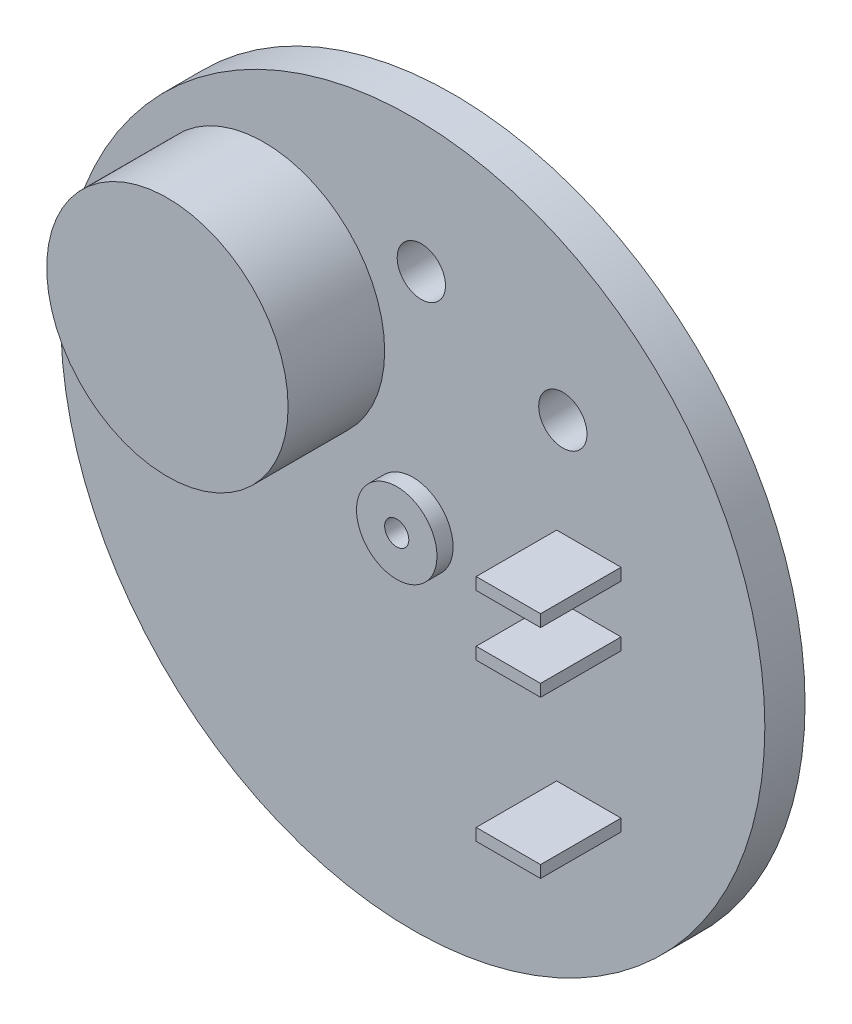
ISO-10303-21;
HEADER;
FILE_DESCRIPTION(('STEP AP214'),'2;1');
FILE_NAME('part.step','',(''),(''),'','','');
FILE_SCHEMA(('AUTOMOTIVE_DESIGN { 1 0 10303 214 1 1 1 1 }'));
ENDSEC;
DATA;
#1=APPLICATION_CONTEXT('core data for automotive mechanical design processes');
#2=APPLICATION_PROTOCOL_DEFINITION('international standard','automotive_design',2000,#1);
#3=PRODUCT_CONTEXT('',#1,'mechanical');
#4=PRODUCT('Part','Part','',(#3));
#5=PRODUCT_RELATED_PRODUCT_CATEGORY('part','',(#4));
#6=PRODUCT_DEFINITION_FORMATION('','',#4);
#7=PRODUCT_DEFINITION_CONTEXT('part definition',#1,'design');
#8=PRODUCT_DEFINITION('design','',#6,#7);
#9=PRODUCT_DEFINITION_SHAPE('','',#8);
#10=(LENGTH_UNIT() NAMED_UNIT(*) SI_UNIT(.MILLI.,.METRE.));
#11=(NAMED_UNIT(*) PLANE_ANGLE_UNIT() SI_UNIT($,.RADIAN.));
#12=(NAMED_UNIT(*) SI_UNIT($,.STERADIAN.) SOLID_ANGLE_UNIT());
#13=UNCERTAINTY_MEASURE_WITH_UNIT(LENGTH_MEASURE(1.E-05),#10,'distance_accuracy_value','');
#14=(GEOMETRIC_REPRESENTATION_CONTEXT(3) GLOBAL_UNCERTAINTY_ASSIGNED_CONTEXT((#13)) GLOBAL_UNIT_ASSIGNED_CONTEXT((#10,
#11,#12)) REPRESENTATION_CONTEXT('',''));
#15=CARTESIAN_POINT('',(0.,0.,0.));
#16=DIRECTION('',(0.,0.,1.));
#17=DIRECTION('',(1.,0.,0.));
#18=AXIS2_PLACEMENT_3D('',#15,#16,#17);
#19=CARTESIAN_POINT('',(0.,0.,5.));
#20=DIRECTION('',(0.,0.,1.));
#21=DIRECTION('',(1.,0.,0.));
#22=AXIS2_PLACEMENT_3D('',#19,#20,#21);
#23=PLANE('',#22);
#24=CARTESIAN_POINT('',(1.05618677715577,27.6610641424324,5.));
#25=DIRECTION('',(0.,0.,1.));
#26=DIRECTION('',(1.,0.,0.));
#27=AXIS2_PLACEMENT_3D('',#24,#25,#26);
#28=CIRCLE('',#27,3.);
#29=CARTESIAN_POINT('',(4.05618677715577,27.6610641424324,5.));
#30=VERTEX_POINT('',#29);
#31=EDGE_CURVE('E331',#30,#30,#28,.T.);
#32=ORIENTED_EDGE('',*,*,#31,.F.);
#33=EDGE_LOOP('',(#32));
#34=FACE_BOUND('',#33,.T.);
#35=CARTESIAN_POINT('',(18.6404268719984,20.4642245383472,5.));
#36=DIRECTION('',(0.,0.,1.));
#37=DIRECTION('',(1.,0.,0.));
#38=AXIS2_PLACEMENT_3D('',#35,#36,#37);
#39=CIRCLE('',#38,3.);
#40=CARTESIAN_POINT('',(21.6404268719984,20.4642245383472,5.));
#41=VERTEX_POINT('',#40);
#42=EDGE_CURVE('E334',#41,#41,#39,.T.);
#43=ORIENTED_EDGE('',*,*,#42,.F.);
#44=EDGE_LOOP('',(#43));
#45=FACE_BOUND('',#44,.T.);
#46=DIRECTION('',(-1.,0.,0.));
#47=VECTOR('',#46,1.);
#48=CARTESIAN_POINT('',(17.875,-18.75,5.));
#49=LINE('',#48,#47);
#50=CARTESIAN_POINT('',(25.875,-18.75,5.));
#51=VERTEX_POINT('',#50);
#52=CARTESIAN_POINT('',(17.875,-18.75,5.));
#53=VERTEX_POINT('',#52);
#54=EDGE_CURVE('E150',#51,#53,#49,.T.);
#55=ORIENTED_EDGE('',*,*,#54,.F.);
#56=DIRECTION('',(0.,1.,0.));
#57=VECTOR('',#56,1.);
#58=CARTESIAN_POINT('',(25.875,-20.25,5.));
#59=LINE('',#58,#57);
#60=CARTESIAN_POINT('',(25.875,-20.25,5.));
#61=VERTEX_POINT('',#60);
#62=EDGE_CURVE('E144',#61,#51,#59,.T.);
#63=ORIENTED_EDGE('',*,*,#62,.F.);
#64=DIRECTION('',(1.,0.,0.));
#65=VECTOR('',#64,1.);
#66=CARTESIAN_POINT('',(17.875,-20.25,5.));
#67=LINE('',#66,#65);
#68=CARTESIAN_POINT('',(17.875,-20.25,5.));
#69=VERTEX_POINT('',#68);
#70=EDGE_CURVE('E129',#69,#61,#67,.T.);
#71=ORIENTED_EDGE('',*,*,#70,.F.);
#72=DIRECTION('',(0.,-1.,0.));
#73=VECTOR('',#72,1.);
#74=CARTESIAN_POINT('',(17.875,-20.25,5.));
#75=LINE('',#74,#73);
#76=EDGE_CURVE('E137',#53,#69,#75,.T.);
#77=ORIENTED_EDGE('',*,*,#76,.F.);
#78=EDGE_LOOP('',(#55,#63,#71,#77));
#79=FACE_BOUND('',#78,.T.);
#80=DIRECTION('',(-1.,0.,0.));
#81=VECTOR('',#80,1.);
#82=CARTESIAN_POINT('',(17.875,8.25,5.));
#83=LINE('',#82,#81);
#84=CARTESIAN_POINT('',(25.875,8.25,5.));
#85=VERTEX_POINT('',#84);
#86=CARTESIAN_POINT('',(17.875,8.25,5.));
#87=VERTEX_POINT('',#86);
#88=EDGE_CURVE('E176',#85,#87,#83,.T.);
#89=ORIENTED_EDGE('',*,*,#88,.F.);
#90=DIRECTION('',(0.,1.,0.));
#91=VECTOR('',#90,1.);
#92=CARTESIAN_POINT('',(25.875,6.75,5.));
#93=LINE('',#92,#91);
#94=CARTESIAN_POINT('',(25.875,6.75,5.));
#95=VERTEX_POINT('',#94);
#96=EDGE_CURVE('E178',#95,#85,#93,.T.);
#97=ORIENTED_EDGE('',*,*,#96,.F.);
#98=DIRECTION('',(1.,0.,0.));
#99=VECTOR('',#98,1.);
#100=CARTESIAN_POINT('',(17.875,6.75,5.));
#101=LINE('',#100,#99);
#102=CARTESIAN_POINT('',(17.875,6.75,5.));
#103=VERTEX_POINT('',#102);
#104=EDGE_CURVE('E171',#103,#95,#101,.T.);
#105=ORIENTED_EDGE('',*,*,#104,.F.);
#106=DIRECTION('',(0.,-1.,0.));
#107=VECTOR('',#106,1.);
#108=CARTESIAN_POINT('',(17.875,6.75,5.));
#109=LINE('',#108,#107);
#110=EDGE_CURVE('E173',#87,#103,#109,.T.);
#111=ORIENTED_EDGE('',*,*,#110,.F.);
#112=EDGE_LOOP('',(#89,#97,#105,#111));
#113=FACE_BOUND('',#112,.T.);
#114=DIRECTION('',(-1.,0.,0.));
#115=VECTOR('',#114,1.);
#116=CARTESIAN_POINT('',(17.875,0.75,5.));
#117=LINE('',#116,#115);
#118=CARTESIAN_POINT('',(25.875,0.75,5.));
#119=VERTEX_POINT('',#118);
#120=CARTESIAN_POINT('',(17.875,0.75,5.));
#121=VERTEX_POINT('',#120);
#122=EDGE_CURVE('E202',#119,#121,#117,.T.);
#123=ORIENTED_EDGE('',*,*,#122,.F.);
#124=DIRECTION('',(0.,1.,0.));
#125=VECTOR('',#124,1.);
#126=CARTESIAN_POINT('',(25.875,-0.75,5.));
#127=LINE('',#126,#125);
#128=CARTESIAN_POINT('',(25.875,-0.75,5.));
#129=VERTEX_POINT('',#128);
#130=EDGE_CURVE('E181',#129,#119,#127,.T.);
#131=ORIENTED_EDGE('',*,*,#130,.F.);
#132=DIRECTION('',(1.,0.,0.));
#133=VECTOR('',#132,1.);
#134=CARTESIAN_POINT('',(17.875,-0.75,5.));
#135=LINE('',#134,#133);
#136=CARTESIAN_POINT('',(17.875,-0.75,5.));
#137=VERTEX_POINT('',#136);
#138=EDGE_CURVE('E193',#137,#129,#135,.T.);
#139=ORIENTED_EDGE('',*,*,#138,.F.);
#140=DIRECTION('',(0.,-1.,0.));
#141=VECTOR('',#140,1.);
#142=CARTESIAN_POINT('',(17.875,-0.75,5.));
#143=LINE('',#142,#141);
#144=EDGE_CURVE('E204',#121,#137,#143,.T.);
#145=ORIENTED_EDGE('',*,*,#144,.F.);
#146=EDGE_LOOP('',(#123,#131,#139,#145));
#147=FACE_BOUND('',#146,.T.);
#148=CARTESIAN_POINT('',(0.,0.,5.));
#149=DIRECTION('',(0.,0.,1.));
#150=DIRECTION('',(1.,0.,0.));
#151=AXIS2_PLACEMENT_3D('',#148,#149,#150);
#152=CIRCLE('',#151,43.75);
#153=CARTESIAN_POINT('',(43.75,0.,5.));
#154=VERTEX_POINT('',#153);
#155=EDGE_CURVE('E11',#154,#154,#152,.T.);
#156=ORIENTED_EDGE('',*,*,#155,.T.);
#157=EDGE_LOOP('',(#156));
#158=FACE_BOUND('',#157,.T.);
#159=CARTESIAN_POINT('',(-18.5,16.8151717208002,5.));
#160=DIRECTION('',(0.,0.,1.));
#161=DIRECTION('',(1.,0.,0.));
#162=AXIS2_PLACEMENT_3D('',#159,#160,#161);
#163=CIRCLE('',#162,15.);
#164=CARTESIAN_POINT('',(-3.5,16.8151717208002,5.));
#165=VERTEX_POINT('',#164);
#166=EDGE_CURVE('E217',#165,#165,#163,.T.);
#167=ORIENTED_EDGE('',*,*,#166,.F.);
#168=EDGE_LOOP('',(#167));
#169=FACE_BOUND('',#168,.T.);
#170=CARTESIAN_POINT('',(0.,0.,5.));
#171=DIRECTION('',(0.,0.,1.));
#172=DIRECTION('',(1.,0.,0.));
#173=AXIS2_PLACEMENT_3D('',#170,#171,#172);
#174=CIRCLE('',#173,5.);
#175=CARTESIAN_POINT('',(5.,0.,5.));
#176=VERTEX_POINT('',#175);
#177=EDGE_CURVE('E346',#176,#176,#174,.T.);
#178=ORIENTED_EDGE('',*,*,#177,.F.);
#179=EDGE_LOOP('',(#178));
#180=FACE_BOUND('',#179,.T.);
#181=ADVANCED_FACE('F39',(#34,#45,#79,#113,#147,#158,#169,#180),#23,.T.);
#182=CARTESIAN_POINT('',(0.,0.,0.));
#183=DIRECTION('',(0.,0.,1.));
#184=DIRECTION('',(1.,0.,0.));
#185=AXIS2_PLACEMENT_3D('',#182,#183,#184);
#186=PLANE('',#185);
#187=CARTESIAN_POINT('',(1.05618677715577,27.6610641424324,0.));
#188=DIRECTION('',(0.,0.,-1.));
#189=DIRECTION('',(-1.,0.,0.));
#190=AXIS2_PLACEMENT_3D('',#187,#188,#189);
#191=CIRCLE('',#190,3.);
#192=CARTESIAN_POINT('',(-1.94381322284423,27.6610641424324,0.));
#193=VERTEX_POINT('',#192);
#194=EDGE_CURVE('E333',#193,#193,#191,.T.);
#195=ORIENTED_EDGE('',*,*,#194,.F.);
#196=EDGE_LOOP('',(#195));
#197=FACE_BOUND('',#196,.T.);
#198=CARTESIAN_POINT('',(18.6404268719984,20.4642245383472,0.));
#199=DIRECTION('',(0.,0.,-1.));
#200=DIRECTION('',(-1.,0.,0.));
#201=AXIS2_PLACEMENT_3D('',#198,#199,#200);
#202=CIRCLE('',#201,3.);
#203=CARTESIAN_POINT('',(15.6404268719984,20.4642245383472,0.));
#204=VERTEX_POINT('',#203);
#205=EDGE_CURVE('E335',#204,#204,#202,.T.);
#206=ORIENTED_EDGE('',*,*,#205,.F.);
#207=EDGE_LOOP('',(#206));
#208=FACE_BOUND('',#207,.T.);
#209=CARTESIAN_POINT('',(0.,0.,0.));
#210=DIRECTION('',(0.,0.,1.));
#211=DIRECTION('',(1.,0.,0.));
#212=AXIS2_PLACEMENT_3D('',#209,#210,#211);
#213=CIRCLE('',#212,43.75);
#214=CARTESIAN_POINT('',(43.75,0.,0.));
#215=VERTEX_POINT('',#214);
#216=EDGE_CURVE('E43',#215,#215,#213,.T.);
#217=ORIENTED_EDGE('',*,*,#216,.F.);
#218=EDGE_LOOP('',(#217));
#219=FACE_BOUND('',#218,.T.);
#220=CARTESIAN_POINT('',(0.,0.,0.));
#221=DIRECTION('',(0.,0.,1.));
#222=DIRECTION('',(1.,0.,0.));
#223=AXIS2_PLACEMENT_3D('',#220,#221,#222);
#224=CIRCLE('',#223,1.5);
#225=CARTESIAN_POINT('',(1.5,0.,0.));
#226=VERTEX_POINT('',#225);
#227=EDGE_CURVE('E221',#226,#226,#224,.T.);
#228=ORIENTED_EDGE('',*,*,#227,.T.);
#229=EDGE_LOOP('',(#228));
#230=FACE_BOUND('',#229,.T.);
#231=ADVANCED_FACE('F231',(#197,#208,#219,#230),#186,.F.);
#232=CARTESIAN_POINT('',(0.,0.,5.));
#233=DIRECTION('',(0.,0.,-1.));
#234=DIRECTION('',(-1.,0.,0.));
#235=AXIS2_PLACEMENT_3D('',#232,#233,#234);
#236=CYLINDRICAL_SURFACE('',#235,43.75);
#237=ORIENTED_EDGE('',*,*,#155,.F.);
#238=EDGE_LOOP('',(#237));
#239=FACE_BOUND('',#238,.T.);
#240=ORIENTED_EDGE('',*,*,#216,.T.);
#241=EDGE_LOOP('',(#240));
#242=FACE_BOUND('',#241,.T.);
#243=ADVANCED_FACE('F41',(#239,#242),#236,.T.);
#244=CARTESIAN_POINT('',(0.,0.,5.));
#245=DIRECTION('',(0.,0.,-1.));
#246=DIRECTION('',(-1.,0.,0.));
#247=AXIS2_PLACEMENT_3D('',#244,#245,#246);
#248=CYLINDRICAL_SURFACE('',#247,1.5);
#249=ORIENTED_EDGE('',*,*,#227,.F.);
#250=EDGE_LOOP('',(#249));
#251=FACE_BOUND('',#250,.T.);
#252=CARTESIAN_POINT('',(0.,0.,7.));
#253=DIRECTION('',(0.,0.,1.));
#254=DIRECTION('',(1.,0.,0.));
#255=AXIS2_PLACEMENT_3D('',#252,#253,#254);
#256=CIRCLE('',#255,1.5);
#257=CARTESIAN_POINT('',(1.5,0.,7.));
#258=VERTEX_POINT('',#257);
#259=EDGE_CURVE('E343',#258,#258,#256,.T.);
#260=ORIENTED_EDGE('',*,*,#259,.T.);
#261=EDGE_LOOP('',(#260));
#262=FACE_BOUND('',#261,.T.);
#263=ADVANCED_FACE('F239',(#251,#262),#248,.F.);
#264=CARTESIAN_POINT('',(-18.5,16.8151717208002,17.));
#265=DIRECTION('',(0.,0.,-1.));
#266=DIRECTION('',(-1.,0.,0.));
#267=AXIS2_PLACEMENT_3D('',#264,#265,#266);
#268=CYLINDRICAL_SURFACE('',#267,15.);
#269=CARTESIAN_POINT('',(-18.5,16.8151717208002,17.));
#270=DIRECTION('',(0.,0.,1.));
#271=DIRECTION('',(1.,0.,0.));
#272=AXIS2_PLACEMENT_3D('',#269,#270,#271);
#273=CIRCLE('',#272,15.);
#274=CARTESIAN_POINT('',(-3.5,16.8151717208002,17.));
#275=VERTEX_POINT('',#274);
#276=EDGE_CURVE('E218',#275,#275,#273,.T.);
#277=ORIENTED_EDGE('',*,*,#276,.F.);
#278=EDGE_LOOP('',(#277));
#279=FACE_BOUND('',#278,.T.);
#280=ORIENTED_EDGE('',*,*,#166,.T.);
#281=EDGE_LOOP('',(#280));
#282=FACE_BOUND('',#281,.T.);
#283=ADVANCED_FACE('F248',(#279,#282),#268,.T.);
#284=CARTESIAN_POINT('',(-18.5,16.8151717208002,17.));
#285=DIRECTION('',(0.,0.,1.));
#286=DIRECTION('',(1.,0.,0.));
#287=AXIS2_PLACEMENT_3D('',#284,#285,#286);
#288=PLANE('',#287);
#289=ORIENTED_EDGE('',*,*,#276,.T.);
#290=EDGE_LOOP('',(#289));
#291=FACE_BOUND('',#290,.T.);
#292=ADVANCED_FACE('F252',(#291),#288,.T.);
#293=CARTESIAN_POINT('',(25.875,-0.75,15.));
#294=DIRECTION('',(-1.,0.,0.));
#295=DIRECTION('',(0.,0.,1.));
#296=AXIS2_PLACEMENT_3D('',#293,#294,#295);
#297=PLANE('',#296);
#298=ORIENTED_EDGE('',*,*,#130,.T.);
#299=DIRECTION('',(0.,0.,-1.));
#300=VECTOR('',#299,1.);
#301=CARTESIAN_POINT('',(25.875,0.75,15.));
#302=LINE('',#301,#300);
#303=CARTESIAN_POINT('',(25.875,0.75,15.));
#304=VERTEX_POINT('',#303);
#305=EDGE_CURVE('E215',#304,#119,#302,.T.);
#306=ORIENTED_EDGE('',*,*,#305,.F.);
#307=DIRECTION('',(0.,1.,0.));
#308=VECTOR('',#307,1.);
#309=CARTESIAN_POINT('',(25.875,-0.75,15.));
#310=LINE('',#309,#308);
#311=CARTESIAN_POINT('',(25.875,-0.75,15.));
#312=VERTEX_POINT('',#311);
#313=EDGE_CURVE('E189',#312,#304,#310,.T.);
#314=ORIENTED_EDGE('',*,*,#313,.F.);
#315=DIRECTION('',(0.,0.,-1.));
#316=VECTOR('',#315,1.);
#317=CARTESIAN_POINT('',(25.875,-0.75,15.));
#318=LINE('',#317,#316);
#319=EDGE_CURVE('E199',#312,#129,#318,.T.);
#320=ORIENTED_EDGE('',*,*,#319,.T.);
#321=EDGE_LOOP('',(#298,#306,#314,#320));
#322=FACE_BOUND('',#321,.T.);
#323=ADVANCED_FACE('F256',(#322),#297,.F.);
#324=CARTESIAN_POINT('',(17.875,0.75,15.));
#325=DIRECTION('',(0.,-1.,0.));
#326=DIRECTION('',(0.,0.,-1.));
#327=AXIS2_PLACEMENT_3D('',#324,#325,#326);
#328=PLANE('',#327);
#329=ORIENTED_EDGE('',*,*,#122,.T.);
#330=DIRECTION('',(0.,0.,-1.));
#331=VECTOR('',#330,1.);
#332=CARTESIAN_POINT('',(17.875,0.75,15.));
#333=LINE('',#332,#331);
#334=CARTESIAN_POINT('',(17.875,0.75,15.));
#335=VERTEX_POINT('',#334);
#336=EDGE_CURVE('E212',#335,#121,#333,.T.);
#337=ORIENTED_EDGE('',*,*,#336,.F.);
#338=DIRECTION('',(-1.,0.,0.));
#339=VECTOR('',#338,1.);
#340=CARTESIAN_POINT('',(17.875,0.75,15.));
#341=LINE('',#340,#339);
#342=EDGE_CURVE('E192',#304,#335,#341,.T.);
#343=ORIENTED_EDGE('',*,*,#342,.F.);
#344=ORIENTED_EDGE('',*,*,#305,.T.);
#345=EDGE_LOOP('',(#329,#337,#343,#344));
#346=FACE_BOUND('',#345,.T.);
#347=ADVANCED_FACE('F260',(#346),#328,.F.);
#348=CARTESIAN_POINT('',(17.875,-0.75,15.));
#349=DIRECTION('',(1.,0.,0.));
#350=DIRECTION('',(0.,0.,-1.));
#351=AXIS2_PLACEMENT_3D('',#348,#349,#350);
#352=PLANE('',#351);
#353=ORIENTED_EDGE('',*,*,#144,.T.);
#354=DIRECTION('',(0.,0.,-1.));
#355=VECTOR('',#354,1.);
#356=CARTESIAN_POINT('',(17.875,-0.75,15.));
#357=LINE('',#356,#355);
#358=CARTESIAN_POINT('',(17.875,-0.75,15.));
#359=VERTEX_POINT('',#358);
#360=EDGE_CURVE('E210',#359,#137,#357,.T.);
#361=ORIENTED_EDGE('',*,*,#360,.F.);
#362=DIRECTION('',(0.,-1.,0.));
#363=VECTOR('',#362,1.);
#364=CARTESIAN_POINT('',(17.875,-0.75,15.));
#365=LINE('',#364,#363);
#366=EDGE_CURVE('E195',#335,#359,#365,.T.);
#367=ORIENTED_EDGE('',*,*,#366,.F.);
#368=ORIENTED_EDGE('',*,*,#336,.T.);
#369=EDGE_LOOP('',(#353,#361,#367,#368));
#370=FACE_BOUND('',#369,.T.);
#371=ADVANCED_FACE('F264',(#370),#352,.F.);
#372=CARTESIAN_POINT('',(17.875,-0.75,15.));
#373=DIRECTION('',(0.,1.,0.));
#374=DIRECTION('',(0.,0.,1.));
#375=AXIS2_PLACEMENT_3D('',#372,#373,#374);
#376=PLANE('',#375);
#377=ORIENTED_EDGE('',*,*,#138,.T.);
#378=ORIENTED_EDGE('',*,*,#319,.F.);
#379=DIRECTION('',(1.,0.,0.));
#380=VECTOR('',#379,1.);
#381=CARTESIAN_POINT('',(17.875,-0.75,15.));
#382=LINE('',#381,#380);
#383=EDGE_CURVE('E197',#359,#312,#382,.T.);
#384=ORIENTED_EDGE('',*,*,#383,.F.);
#385=ORIENTED_EDGE('',*,*,#360,.T.);
#386=EDGE_LOOP('',(#377,#378,#384,#385));
#387=FACE_BOUND('',#386,.T.);
#388=ADVANCED_FACE('F268',(#387),#376,.F.);
#389=CARTESIAN_POINT('',(0.,0.,15.));
#390=DIRECTION('',(0.,0.,-1.));
#391=DIRECTION('',(-1.,0.,0.));
#392=AXIS2_PLACEMENT_3D('',#389,#390,#391);
#393=PLANE('',#392);
#394=ORIENTED_EDGE('',*,*,#313,.T.);
#395=ORIENTED_EDGE('',*,*,#342,.T.);
#396=ORIENTED_EDGE('',*,*,#366,.T.);
#397=ORIENTED_EDGE('',*,*,#383,.T.);
#398=EDGE_LOOP('',(#394,#395,#396,#397));
#399=FACE_BOUND('',#398,.T.);
#400=ADVANCED_FACE('F272',(#399),#393,.F.);
#401=CARTESIAN_POINT('',(25.875,6.75,15.));
#402=DIRECTION('',(-1.,0.,0.));
#403=DIRECTION('',(0.,0.,1.));
#404=AXIS2_PLACEMENT_3D('',#401,#402,#403);
#405=PLANE('',#404);
#406=ORIENTED_EDGE('',*,*,#96,.T.);
#407=DIRECTION('',(0.,0.,-1.));
#408=VECTOR('',#407,1.);
#409=CARTESIAN_POINT('',(25.875,8.25,15.));
#410=LINE('',#409,#408);
#411=CARTESIAN_POINT('',(25.875,8.25,15.));
#412=VERTEX_POINT('',#411);
#413=EDGE_CURVE('E151',#412,#85,#410,.T.);
#414=ORIENTED_EDGE('',*,*,#413,.F.);
#415=DIRECTION('',(0.,1.,0.));
#416=VECTOR('',#415,1.);
#417=CARTESIAN_POINT('',(25.875,6.75,15.));
#418=LINE('',#417,#416);
#419=CARTESIAN_POINT('',(25.875,6.75,15.));
#420=VERTEX_POINT('',#419);
#421=EDGE_CURVE('E174',#420,#412,#418,.T.);
#422=ORIENTED_EDGE('',*,*,#421,.F.);
#423=DIRECTION('',(0.,0.,-1.));
#424=VECTOR('',#423,1.);
#425=CARTESIAN_POINT('',(25.875,6.75,15.));
#426=LINE('',#425,#424);
#427=EDGE_CURVE('E167',#420,#95,#426,.T.);
#428=ORIENTED_EDGE('',*,*,#427,.T.);
#429=EDGE_LOOP('',(#406,#414,#422,#428));
#430=FACE_BOUND('',#429,.T.);
#431=ADVANCED_FACE('F276',(#430),#405,.F.);
#432=CARTESIAN_POINT('',(17.875,8.25,15.));
#433=DIRECTION('',(0.,-1.,0.));
#434=DIRECTION('',(0.,0.,-1.));
#435=AXIS2_PLACEMENT_3D('',#432,#433,#434);
#436=PLANE('',#435);
#437=ORIENTED_EDGE('',*,*,#88,.T.);
#438=DIRECTION('',(0.,0.,-1.));
#439=VECTOR('',#438,1.);
#440=CARTESIAN_POINT('',(17.875,8.25,15.));
#441=LINE('',#440,#439);
#442=CARTESIAN_POINT('',(17.875,8.25,15.));
#443=VERTEX_POINT('',#442);
#444=EDGE_CURVE('E153',#443,#87,#441,.T.);
#445=ORIENTED_EDGE('',*,*,#444,.F.);
#446=DIRECTION('',(-1.,0.,0.));
#447=VECTOR('',#446,1.);
#448=CARTESIAN_POINT('',(17.875,8.25,15.));
#449=LINE('',#448,#447);
#450=EDGE_CURVE('E185',#412,#443,#449,.T.);
#451=ORIENTED_EDGE('',*,*,#450,.F.);
#452=ORIENTED_EDGE('',*,*,#413,.T.);
#453=EDGE_LOOP('',(#437,#445,#451,#452));
#454=FACE_BOUND('',#453,.T.);
#455=ADVANCED_FACE('F288',(#454),#436,.F.);
#456=CARTESIAN_POINT('',(17.875,6.75,15.));
#457=DIRECTION('',(1.,0.,0.));
#458=DIRECTION('',(0.,0.,-1.));
#459=AXIS2_PLACEMENT_3D('',#456,#457,#458);
#460=PLANE('',#459);
#461=ORIENTED_EDGE('',*,*,#110,.T.);
#462=DIRECTION('',(0.,0.,-1.));
#463=VECTOR('',#462,1.);
#464=CARTESIAN_POINT('',(17.875,6.75,15.));
#465=LINE('',#464,#463);
#466=CARTESIAN_POINT('',(17.875,6.75,15.));
#467=VERTEX_POINT('',#466);
#468=EDGE_CURVE('E62',#467,#103,#465,.T.);
#469=ORIENTED_EDGE('',*,*,#468,.F.);
#470=DIRECTION('',(0.,-1.,0.));
#471=VECTOR('',#470,1.);
#472=CARTESIAN_POINT('',(17.875,6.75,15.));
#473=LINE('',#472,#471);
#474=EDGE_CURVE('E183',#443,#467,#473,.T.);
#475=ORIENTED_EDGE('',*,*,#474,.F.);
#476=ORIENTED_EDGE('',*,*,#444,.T.);
#477=EDGE_LOOP('',(#461,#469,#475,#476));
#478=FACE_BOUND('',#477,.T.);
#479=ADVANCED_FACE('F285',(#478),#460,.F.);
#480=CARTESIAN_POINT('',(17.875,6.75,15.));
#481=DIRECTION('',(0.,1.,0.));
#482=DIRECTION('',(0.,0.,1.));
#483=AXIS2_PLACEMENT_3D('',#480,#481,#482);
#484=PLANE('',#483);
#485=ORIENTED_EDGE('',*,*,#104,.T.);
#486=ORIENTED_EDGE('',*,*,#427,.F.);
#487=DIRECTION('',(1.,0.,0.));
#488=VECTOR('',#487,1.);
#489=CARTESIAN_POINT('',(17.875,6.75,15.));
#490=LINE('',#489,#488);
#491=EDGE_CURVE('E170',#467,#420,#490,.T.);
#492=ORIENTED_EDGE('',*,*,#491,.F.);
#493=ORIENTED_EDGE('',*,*,#468,.T.);
#494=EDGE_LOOP('',(#485,#486,#492,#493));
#495=FACE_BOUND('',#494,.T.);
#496=ADVANCED_FACE('F281',(#495),#484,.F.);
#497=CARTESIAN_POINT('',(0.,0.,15.));
#498=DIRECTION('',(0.,0.,-1.));
#499=DIRECTION('',(-1.,0.,0.));
#500=AXIS2_PLACEMENT_3D('',#497,#498,#499);
#501=PLANE('',#500);
#502=ORIENTED_EDGE('',*,*,#421,.T.);
#503=ORIENTED_EDGE('',*,*,#450,.T.);
#504=ORIENTED_EDGE('',*,*,#474,.T.);
#505=ORIENTED_EDGE('',*,*,#491,.T.);
#506=EDGE_LOOP('',(#502,#503,#504,#505));
#507=FACE_BOUND('',#506,.T.);
#508=ADVANCED_FACE('F278',(#507),#501,.F.);
#509=CARTESIAN_POINT('',(25.875,-20.25,15.));
#510=DIRECTION('',(-1.,0.,0.));
#511=DIRECTION('',(0.,0.,1.));
#512=AXIS2_PLACEMENT_3D('',#509,#510,#511);
#513=PLANE('',#512);
#514=ORIENTED_EDGE('',*,*,#62,.T.);
#515=DIRECTION('',(0.,0.,-1.));
#516=VECTOR('',#515,1.);
#517=CARTESIAN_POINT('',(25.875,-18.75,15.));
#518=LINE('',#517,#516);
#519=CARTESIAN_POINT('',(25.875,-18.75,15.));
#520=VERTEX_POINT('',#519);
#521=EDGE_CURVE('E350',#520,#51,#518,.T.);
#522=ORIENTED_EDGE('',*,*,#521,.F.);
#523=DIRECTION('',(0.,1.,0.));
#524=VECTOR('',#523,1.);
#525=CARTESIAN_POINT('',(25.875,-20.25,15.));
#526=LINE('',#525,#524);
#527=CARTESIAN_POINT('',(25.875,-20.25,15.));
#528=VERTEX_POINT('',#527);
#529=EDGE_CURVE('E138',#528,#520,#526,.T.);
#530=ORIENTED_EDGE('',*,*,#529,.F.);
#531=DIRECTION('',(0.,0.,-1.));
#532=VECTOR('',#531,1.);
#533=CARTESIAN_POINT('',(25.875,-20.25,15.));
#534=LINE('',#533,#532);
#535=EDGE_CURVE('E132',#528,#61,#534,.T.);
#536=ORIENTED_EDGE('',*,*,#535,.T.);
#537=EDGE_LOOP('',(#514,#522,#530,#536));
#538=FACE_BOUND('',#537,.T.);
#539=ADVANCED_FACE('F142',(#538),#513,.F.);
#540=CARTESIAN_POINT('',(17.875,-18.75,15.));
#541=DIRECTION('',(0.,-1.,0.));
#542=DIRECTION('',(1.,0.,0.));
#543=AXIS2_PLACEMENT_3D('',#540,#541,#542);
#544=PLANE('',#543);
#545=ORIENTED_EDGE('',*,*,#54,.T.);
#546=DIRECTION('',(0.,0.,-1.));
#547=VECTOR('',#546,1.);
#548=CARTESIAN_POINT('',(17.875,-18.75,15.));
#549=LINE('',#548,#547);
#550=CARTESIAN_POINT('',(17.875,-18.75,15.));
#551=VERTEX_POINT('',#550);
#552=EDGE_CURVE('E354',#551,#53,#549,.T.);
#553=ORIENTED_EDGE('',*,*,#552,.F.);
#554=DIRECTION('',(-1.,0.,0.));
#555=VECTOR('',#554,1.);
#556=CARTESIAN_POINT('',(17.875,-18.75,15.));
#557=LINE('',#556,#555);
#558=EDGE_CURVE('E161',#520,#551,#557,.T.);
#559=ORIENTED_EDGE('',*,*,#558,.F.);
#560=ORIENTED_EDGE('',*,*,#521,.T.);
#561=EDGE_LOOP('',(#545,#553,#559,#560));
#562=FACE_BOUND('',#561,.T.);
#563=ADVANCED_FACE('F306',(#562),#544,.F.);
#564=CARTESIAN_POINT('',(17.875,-20.25,15.));
#565=DIRECTION('',(1.,0.,0.));
#566=DIRECTION('',(0.,0.,-1.));
#567=AXIS2_PLACEMENT_3D('',#564,#565,#566);
#568=PLANE('',#567);
#569=ORIENTED_EDGE('',*,*,#76,.T.);
#570=DIRECTION('',(0.,0.,-1.));
#571=VECTOR('',#570,1.);
#572=CARTESIAN_POINT('',(17.875,-20.25,15.));
#573=LINE('',#572,#571);
#574=CARTESIAN_POINT('',(17.875,-20.25,15.));
#575=VERTEX_POINT('',#574);
#576=EDGE_CURVE('E54',#575,#69,#573,.T.);
#577=ORIENTED_EDGE('',*,*,#576,.F.);
#578=DIRECTION('',(0.,-1.,0.));
#579=VECTOR('',#578,1.);
#580=CARTESIAN_POINT('',(17.875,-20.25,15.));
#581=LINE('',#580,#579);
#582=EDGE_CURVE('E159',#551,#575,#581,.T.);
#583=ORIENTED_EDGE('',*,*,#582,.F.);
#584=ORIENTED_EDGE('',*,*,#552,.T.);
#585=EDGE_LOOP('',(#569,#577,#583,#584));
#586=FACE_BOUND('',#585,.T.);
#587=ADVANCED_FACE('F303',(#586),#568,.F.);
#588=CARTESIAN_POINT('',(17.875,-20.25,15.));
#589=DIRECTION('',(0.,1.,0.));
#590=DIRECTION('',(0.,0.,1.));
#591=AXIS2_PLACEMENT_3D('',#588,#589,#590);
#592=PLANE('',#591);
#593=ORIENTED_EDGE('',*,*,#70,.T.);
#594=ORIENTED_EDGE('',*,*,#535,.F.);
#595=DIRECTION('',(1.,0.,0.));
#596=VECTOR('',#595,1.);
#597=CARTESIAN_POINT('',(17.875,-20.25,15.));
#598=LINE('',#597,#596);
#599=EDGE_CURVE('E147',#575,#528,#598,.T.);
#600=ORIENTED_EDGE('',*,*,#599,.F.);
#601=ORIENTED_EDGE('',*,*,#576,.T.);
#602=EDGE_LOOP('',(#593,#594,#600,#601));
#603=FACE_BOUND('',#602,.T.);
#604=ADVANCED_FACE('F131',(#603),#592,.F.);
#605=CARTESIAN_POINT('',(0.,0.,15.));
#606=DIRECTION('',(0.,0.,-1.));
#607=DIRECTION('',(-1.,0.,0.));
#608=AXIS2_PLACEMENT_3D('',#605,#606,#607);
#609=PLANE('',#608);
#610=ORIENTED_EDGE('',*,*,#529,.T.);
#611=ORIENTED_EDGE('',*,*,#558,.T.);
#612=ORIENTED_EDGE('',*,*,#582,.T.);
#613=ORIENTED_EDGE('',*,*,#599,.T.);
#614=EDGE_LOOP('',(#610,#611,#612,#613));
#615=FACE_BOUND('',#614,.T.);
#616=ADVANCED_FACE('F296',(#615),#609,.F.);
#617=CARTESIAN_POINT('',(0.,0.,7.));
#618=DIRECTION('',(0.,0.,1.));
#619=DIRECTION('',(1.,0.,0.));
#620=AXIS2_PLACEMENT_3D('',#617,#618,#619);
#621=PLANE('',#620);
#622=CARTESIAN_POINT('',(0.,0.,7.));
#623=DIRECTION('',(0.,0.,1.));
#624=DIRECTION('',(1.,0.,0.));
#625=AXIS2_PLACEMENT_3D('',#622,#623,#624);
#626=CIRCLE('',#625,5.);
#627=CARTESIAN_POINT('',(5.,0.,7.));
#628=VERTEX_POINT('',#627);
#629=EDGE_CURVE('E347',#628,#628,#626,.T.);
#630=ORIENTED_EDGE('',*,*,#629,.T.);
#631=EDGE_LOOP('',(#630));
#632=FACE_BOUND('',#631,.T.);
#633=ORIENTED_EDGE('',*,*,#259,.F.);
#634=EDGE_LOOP('',(#633));
#635=FACE_BOUND('',#634,.T.);
#636=ADVANCED_FACE('F299',(#632,#635),#621,.T.);
#637=CARTESIAN_POINT('',(0.,0.,7.));
#638=DIRECTION('',(0.,0.,-1.));
#639=DIRECTION('',(-1.,0.,0.));
#640=AXIS2_PLACEMENT_3D('',#637,#638,#639);
#641=CYLINDRICAL_SURFACE('',#640,5.);
#642=ORIENTED_EDGE('',*,*,#629,.F.);
#643=EDGE_LOOP('',(#642));
#644=FACE_BOUND('',#643,.T.);
#645=ORIENTED_EDGE('',*,*,#177,.T.);
#646=EDGE_LOOP('',(#645));
#647=FACE_BOUND('',#646,.T.);
#648=ADVANCED_FACE('F313',(#644,#647),#641,.T.);
#649=CARTESIAN_POINT('',(18.6404268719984,20.4642245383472,10.));
#650=DIRECTION('',(0.,0.,-1.));
#651=DIRECTION('',(-1.,0.,0.));
#652=AXIS2_PLACEMENT_3D('',#649,#650,#651);
#653=CYLINDRICAL_SURFACE('',#652,3.);
#654=ORIENTED_EDGE('',*,*,#42,.T.);
#655=EDGE_LOOP('',(#654));
#656=FACE_BOUND('',#655,.T.);
#657=ORIENTED_EDGE('',*,*,#205,.T.);
#658=EDGE_LOOP('',(#657));
#659=FACE_BOUND('',#658,.T.);
#660=ADVANCED_FACE('F316',(#656,#659),#653,.F.);
#661=CARTESIAN_POINT('',(1.05618677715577,27.6610641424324,10.));
#662=DIRECTION('',(0.,0.,-1.));
#663=DIRECTION('',(-1.,0.,0.));
#664=AXIS2_PLACEMENT_3D('',#661,#662,#663);
#665=CYLINDRICAL_SURFACE('',#664,3.);
#666=ORIENTED_EDGE('',*,*,#31,.T.);
#667=EDGE_LOOP('',(#666));
#668=FACE_BOUND('',#667,.T.);
#669=ORIENTED_EDGE('',*,*,#194,.T.);
#670=EDGE_LOOP('',(#669));
#671=FACE_BOUND('',#670,.T.);
#672=ADVANCED_FACE('F322',(#668,#671),#665,.F.);
#673=CLOSED_SHELL('',(#181,#231,#243,#263,#283,#292,#323,#347,#371,#388,#400,#431,#455,#479,
#496,#508,#539,#563,#587,#604,#616,#636,#648,#660,#672));
#674=MANIFOLD_SOLID_BREP('B2',#673);
#675=ADVANCED_BREP_SHAPE_REPRESENTATION('',(#18,#674),#14);
#676=SHAPE_DEFINITION_REPRESENTATION(#9,#675);
ENDSEC;
END-ISO-10303-21;
